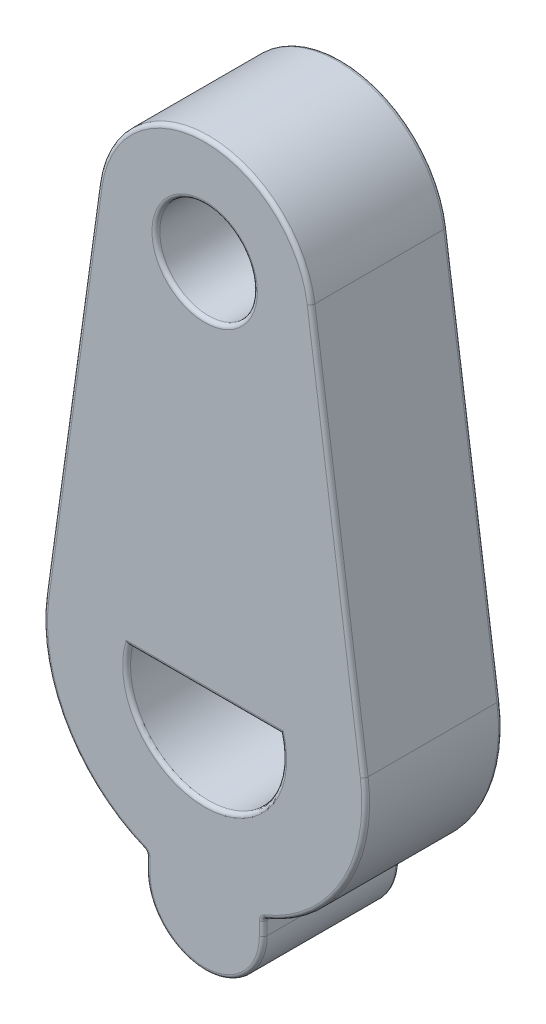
from build123d import *

# Parameters (mm, degrees)
ESQUISSE1_R      = 2.5
EXTRUSION1_DEPTH = 7
ESQUISSE2_R      = 4
EXTRUSION2_DEPTH = 1
CONG_1_R         = 0.2


with BuildPart() as part:
    # Esquisse1 → Extrusion1 (new body)
    with BuildSketch(Plane.XY):
        with BuildLine():
            Line((5.447759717, 20.75625), (8.171639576, 1.134375))
            ThreePointArc((8.171639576, 1.134375), (7.150328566, -4.115252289), (3.124260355, -7.635541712))
            ThreePointArc((3.124260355, -7.635541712), (3.033945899, -7.709173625), (3, -7.820645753))
            Line((3, -7.820645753), (3, -8.5))
            ThreePointArc((3, -8.5), (0, -11.5), (-3, -8.5))
            Line((-3, -8.5), (-3.000624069, -7.820206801))
            ThreePointArc((-3.000624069, -7.820206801), (-3.034616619, -7.708848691), (-3.124869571, -7.635292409))
            ThreePointArc((-3.124869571, -7.635292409), (-7.150492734, -4.11496703), (-8.171639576, 1.134375))
            Line((-8.171639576, 1.134375), (-5.447759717, 20.75625))
            ThreePointArc((-5.447759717, 20.75625), (0, 25.5), (5.447759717, 20.75625))
        make_face()
        with Locations((0, 20)):
            Circle(ESQUISSE1_R, mode=Mode.SUBTRACT)
        with BuildLine():
            Line((-3.872983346, 1), (3.872983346, 1))
            ThreePointArc((3.872983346, 1), (0, -4), (-3.872983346, 1))
        make_face(mode=Mode.SUBTRACT)
    extrude(amount=EXTRUSION1_DEPTH)

    # Esquisse2 → Extrusion2 (add)
    with BuildSketch(Plane(origin=(0, 0, 0), x_dir=(-1, 0, 0), z_dir=(0, 0, -1))):
        with Locations(Location((0, 20, 0), (0, 0, 180))):
            Circle(ESQUISSE2_R)
    extrude(amount=EXTRUSION2_DEPTH)

    # Cong_1
    cong_1_edges = [part.edges().sort_by_distance(p)[0] for p in [
        (-6.809699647, 10.9453125, 0),
        (-6.809699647, 10.9453125, 7),
        (-7.150492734, -4.11496703, 0),
        (-7.150492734, -4.11496703, 7),
        (0, 25.5, 0),
        (0, 25.5, 7),
        (-3.034616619, -7.708848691, 0),
        (6.809699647, 10.9453125, 0),
        (-3.000312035, -8.1601034, 0),
        (7.150328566, -4.115252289, 0),
        (0, -11.5, 0),
        (3.033945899, -7.709173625, 0),
        (3, -8.160322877, 0),
        (0, -4, 0),
        (0, 1, 0),
        (-4, 20, 0),
        (6.809699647, 10.9453125, 7),
        (7.150328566, -4.115252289, 7),
        (3.033945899, -7.709173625, 7),
        (3, -8.160322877, 7),
        (0, -11.5, 7),
        (-3.000312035, -8.1601034, 7),
        (-3.034616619, -7.708848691, 7),
        (-2.5, 20, 7),
        (0, -4, 7),
        (0, 1, 7),
        (-4, 20, -1),
    ]]
    fillet(cong_1_edges, radius=CONG_1_R)


solid = part.part
